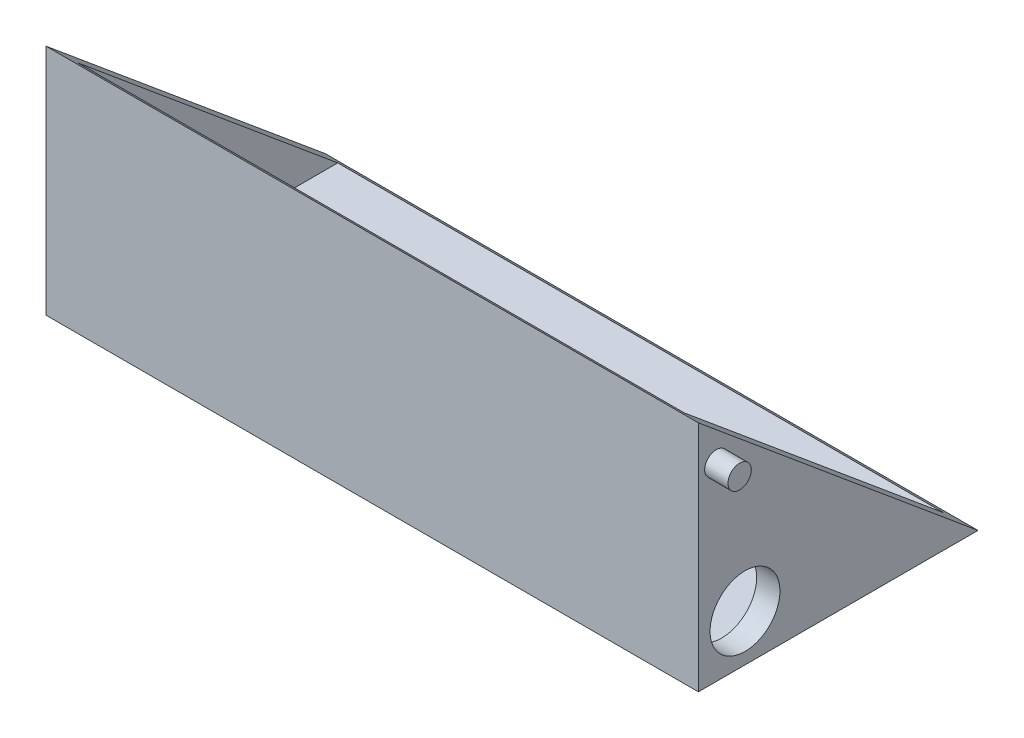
from build123d import *

# Parameters (mm, degrees)
BOSS_EXTRUDE1_DEPTH     = 177.8
SKETCH3_W               = 165.1
SKETCH3_H               = 78.859310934
CUT_EXTRUDE1_DEPTH      = 60.96
CUT_EXTRUDE3_DEPTH      = 204.596488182
CUT_EXTRUDE3_DEPTH_BACK = 204.596488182
SKETCH5_R               = 9.525
SKETCH6_R               = 3.175
BOSS_EXTRUDE2_DEPTH     = 6.35


with BuildPart() as part:
    # Sketch2 → Boss-Extrude1 (new body)
    with BuildSketch(Plane(origin=(0, 0, 0), x_dir=(0, 0, -1), z_dir=(1, 0, 0))):
        Polygon((0, 22.975670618), (0, 0), (76.2, 0), (0, 63.5), align=None)
    extrude(amount=-BOSS_EXTRUDE1_DEPTH)

    # Sketch3 → Cut-Extrude1 (cut)
    with BuildSketch(Plane(origin=(0, 63.5, 0), x_dir=(-1, 0, 0), z_dir=(0, -1, 0))):
        with Locations((88.9, 41.969655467)):
            Rectangle(SKETCH3_W, SKETCH3_H)
    extrude(amount=CUT_EXTRUDE1_DEPTH, mode=Mode.SUBTRACT)

    # Sketch5 → Cut-Extrude3 (cut, two sides: drawn at the far end of the back side and taken through both)
    with BuildSketch(Plane(origin=(0, 0, 0), x_dir=(0, 0, -1), z_dir=(1, 0, 0)).offset(-CUT_EXTRUDE3_DEPTH_BACK)):
        with Locations((12.7, 12.7)):
            Circle(SKETCH5_R)
    extrude(amount=CUT_EXTRUDE3_DEPTH + CUT_EXTRUDE3_DEPTH_BACK, mode=Mode.SUBTRACT)

    # Sketch6 → Boss-Extrude2 (add)
    with BuildSketch(Plane(origin=(0, 0, 0), x_dir=(0, 0, -1), z_dir=(1, 0, 0))):
        with Locations((4.890878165, 51.547140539)):
            Circle(SKETCH6_R)
    extrude(amount=BOSS_EXTRUDE2_DEPTH)


solid = part.part
